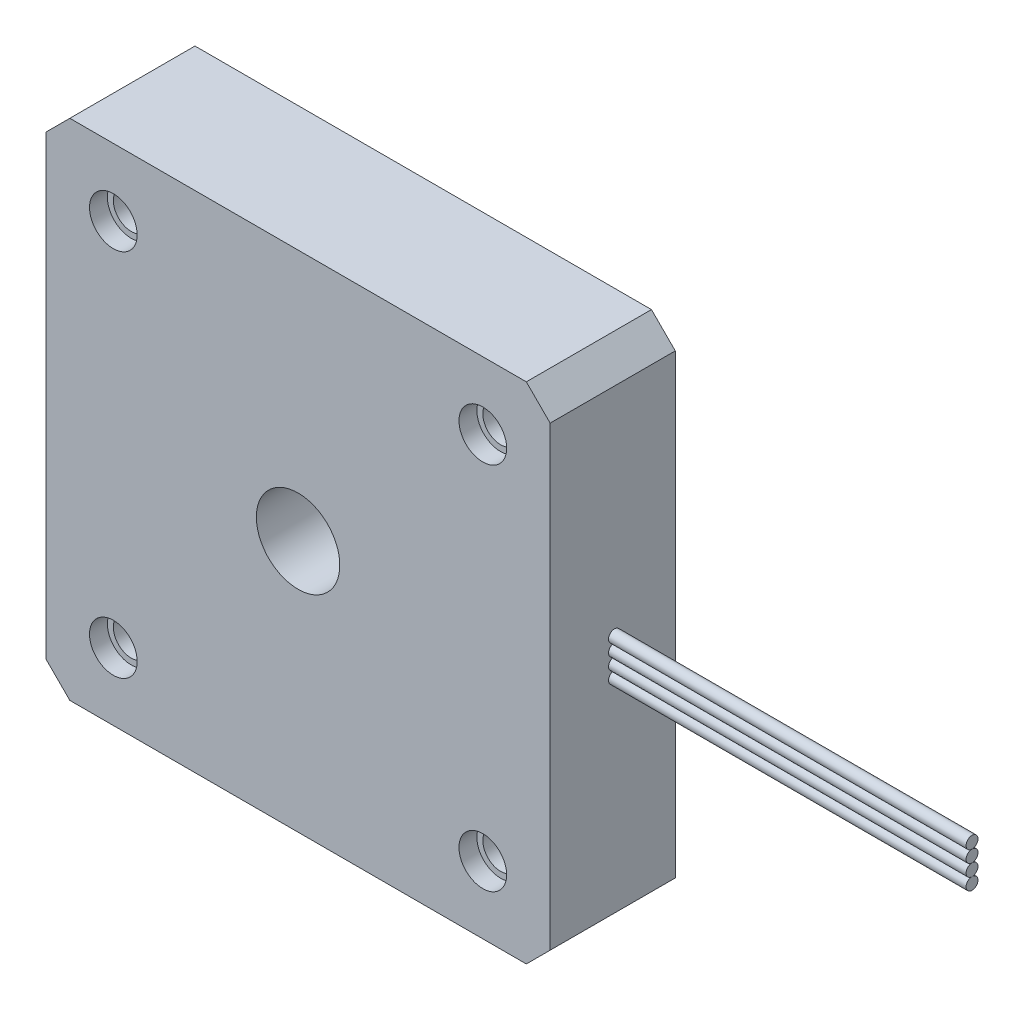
from build123d import *

# Parameters (mm, degrees)
EXTRUDE_1_DEPTH          = 10.5
SKETCH_3_R               = 3.5
CUT_EXTRUDE_1_DEPTH      = 10.5
SKETCH_5_R               = 2
CUT_EXTRUDE_2_DEPTH      = 1.5
SKETCH_6_R               = 1.5
CUT_EXTRUDE_3_DEPTH      = 50
PATTERN_CIRCULAR_1_COUNT = 4
PATTERN_CIRCULAR_2_COUNT = 4
SKETCH_13_R              = 0.5
EXTRUDE_57_DEPTH         = 30
SKETCH_13_4_R            = 0.5
EXTRUDE_75_DEPTH         = 30
SKETCH_13_5_R            = 0.5
EXTRUDE_76_DEPTH         = 30


with BuildPart() as part:
    # Sketch 2 → Extrude 1 (new body)
    with BuildSketch(Plane.XY):
        Polygon((-19.15, 21.15), (-21.15, 19.15), (-21.15, -19.15), (-19.15, -21.15), (19.15, -21.15), (21.15, -19.15), (21.15, 19.15), (19.15, 21.15), align=None)
    extrude(amount=EXTRUDE_1_DEPTH)

    # Sketch 3 → Cut-Extrude 1 (cut)
    with BuildSketch(Plane(origin=(0, 0, 0), x_dir=(-1, 0, 0), z_dir=(0, 0, -1))):
        Circle(SKETCH_3_R)
    extrude(amount=-CUT_EXTRUDE_1_DEPTH, mode=Mode.SUBTRACT)

    # Sketch 5 → Cut-Extrude 2 (cut)
    with BuildSketch(Plane.XY.offset(10.5)):
        with Locations((-15.5, 15.5)):
            Circle(SKETCH_5_R)
    cut_extrude_2 = extrude(amount=-CUT_EXTRUDE_2_DEPTH, mode=Mode.SUBTRACT)

    # Sketch 6 → Cut-Extrude 3 (cut)
    with BuildSketch(Plane.XY.offset(9)):
        with Locations((-15.5, 15.5)):
            Circle(SKETCH_6_R)
    cut_extrude_3 = extrude(amount=-CUT_EXTRUDE_3_DEPTH, mode=Mode.SUBTRACT)

    # Pattern Circular 1: Cut-Extrude 3 ×4 about axis
    pattern_circular_1_axis = Axis((0, 0, 0), (0, 0, 1))
    for i in range(1, PATTERN_CIRCULAR_1_COUNT):
        add(cut_extrude_3.rotate(pattern_circular_1_axis, i * 360 / PATTERN_CIRCULAR_1_COUNT), mode=Mode.SUBTRACT)

    # Pattern Circular 2: Cut-Extrude 2 ×4 about axis
    pattern_circular_2_axis = Axis((0, 0, 0), (0, 0, 1))
    for i in range(1, PATTERN_CIRCULAR_2_COUNT):
        add(cut_extrude_2.rotate(pattern_circular_2_axis, i * 360 / PATTERN_CIRCULAR_2_COUNT), mode=Mode.SUBTRACT)

    # Sketch 13 → Extrude 57 (add)
    with BuildSketch(Plane(origin=(21.15, 0, 0), x_dir=(0, 0, -1), z_dir=(1, 0, 0))):
        with Locations(Location((-5.10242148, 1, 0), (0, 0, 180))):
            Circle(SKETCH_13_R)
        with Locations(Location((-5.10242148, -2, 0), (0, 0, 180))):
            Circle(SKETCH_13_R)
    extrude(amount=EXTRUDE_57_DEPTH)


with BuildPart() as body_2:
    # Sketch 13_4 → Extrude 75 (new body)
    with BuildSketch(Plane(origin=(21.15, 0, 0), x_dir=(0, 0, -1), z_dir=(1, 0, 0))):
        with Locations((-5.10242148, 0)):
            Circle(SKETCH_13_4_R)
    extrude(amount=EXTRUDE_75_DEPTH)


with BuildPart() as body_3:
    # Sketch 13_5 → Extrude 76 (new body)
    with BuildSketch(Plane(origin=(21.15, 0, 0), x_dir=(0, 0, -1), z_dir=(1, 0, 0))):
        with Locations((-5.10242148, -1)):
            Circle(SKETCH_13_5_R)
    extrude(amount=EXTRUDE_76_DEPTH)


solid = Compound([part.part, body_2.part, body_3.part])
